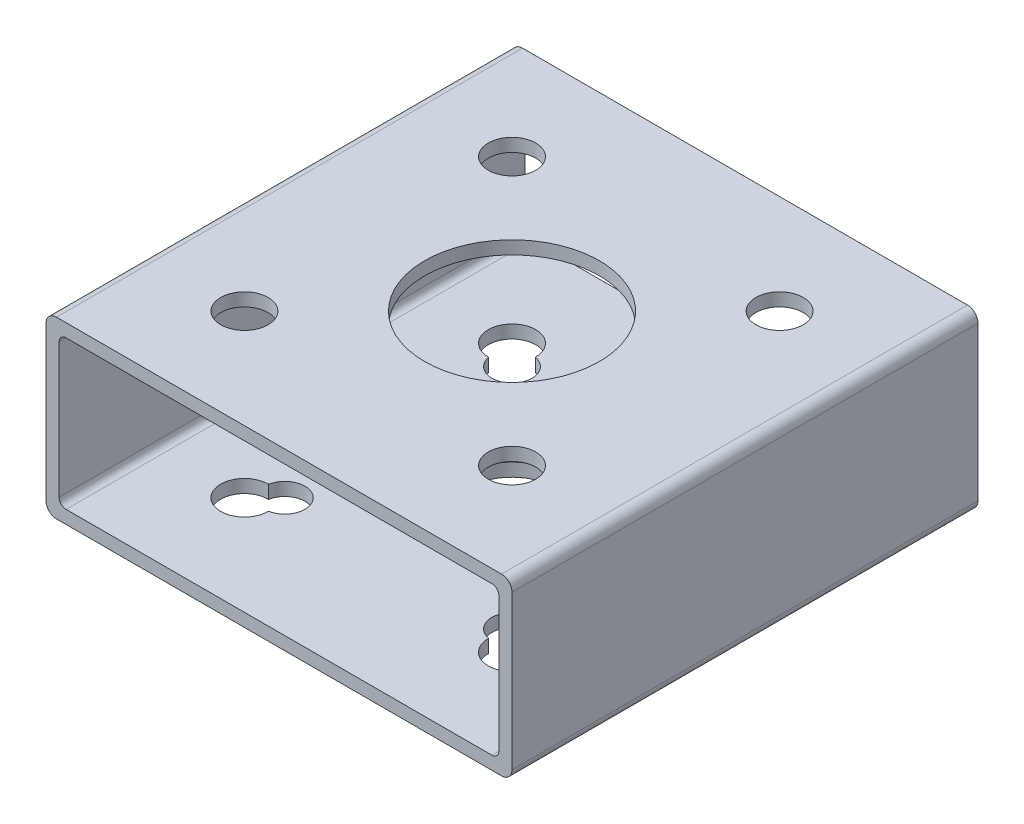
ISO-10303-21;
HEADER;
FILE_DESCRIPTION(('STEP AP214'),'2;1');
FILE_NAME('part.step','',(''),(''),'','','');
FILE_SCHEMA(('AUTOMOTIVE_DESIGN { 1 0 10303 214 1 1 1 1 }'));
ENDSEC;
DATA;
#1=APPLICATION_CONTEXT('core data for automotive mechanical design processes');
#2=APPLICATION_PROTOCOL_DEFINITION('international standard','automotive_design',2000,#1);
#3=PRODUCT_CONTEXT('',#1,'mechanical');
#4=PRODUCT('Part','Part','',(#3));
#5=PRODUCT_RELATED_PRODUCT_CATEGORY('part','',(#4));
#6=PRODUCT_DEFINITION_FORMATION('','',#4);
#7=PRODUCT_DEFINITION_CONTEXT('part definition',#1,'design');
#8=PRODUCT_DEFINITION('design','',#6,#7);
#9=PRODUCT_DEFINITION_SHAPE('','',#8);
#10=(LENGTH_UNIT() NAMED_UNIT(*) SI_UNIT(.MILLI.,.METRE.));
#11=(NAMED_UNIT(*) PLANE_ANGLE_UNIT() SI_UNIT($,.RADIAN.));
#12=(NAMED_UNIT(*) SI_UNIT($,.STERADIAN.) SOLID_ANGLE_UNIT());
#13=UNCERTAINTY_MEASURE_WITH_UNIT(LENGTH_MEASURE(1.E-05),#10,'distance_accuracy_value','');
#14=(GEOMETRIC_REPRESENTATION_CONTEXT(3) GLOBAL_UNCERTAINTY_ASSIGNED_CONTEXT((#13)) GLOBAL_UNIT_ASSIGNED_CONTEXT((#10,
#11,#12)) REPRESENTATION_CONTEXT('',''));
#15=CARTESIAN_POINT('',(0.,0.,0.));
#16=DIRECTION('',(0.,0.,1.));
#17=DIRECTION('',(1.,0.,0.));
#18=AXIS2_PLACEMENT_3D('',#15,#16,#17);
#19=CARTESIAN_POINT('',(203.2,0.,-203.2));
#20=DIRECTION('',(0.,-1.,0.));
#21=DIRECTION('',(1.,0.,0.));
#22=AXIS2_PLACEMENT_3D('',#19,#20,#21);
#23=PLANE('',#22);
#24=CARTESIAN_POINT('',(43.2636905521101,0.,-43.2636905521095));
#25=DIRECTION('',(0.,-1.,0.));
#26=DIRECTION('',(1.,0.,0.));
#27=AXIS2_PLACEMENT_3D('',#24,#25,#26);
#28=CIRCLE('',#27,10.3251);
#29=CARTESIAN_POINT('',(53.5872960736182,0.,-43.4393579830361));
#30=VERTEX_POINT('',#29);
#31=CARTESIAN_POINT('',(43.439357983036,0.,-53.5872960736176));
#32=VERTEX_POINT('',#31);
#33=EDGE_CURVE('E189',#30,#32,#28,.T.);
#34=ORIENTED_EDGE('',*,*,#33,.F.);
#35=CARTESIAN_POINT('',(52.07,0.,-52.07));
#36=DIRECTION('',(0.,-1.,0.));
#37=DIRECTION('',(1.,0.,0.));
#38=AXIS2_PLACEMENT_3D('',#35,#36,#37);
#39=CIRCLE('',#38,8.763);
#40=EDGE_CURVE('E198',#32,#30,#39,.T.);
#41=ORIENTED_EDGE('',*,*,#40,.F.);
#42=EDGE_LOOP('',(#34,#41));
#43=FACE_BOUND('',#42,.T.);
#44=CARTESIAN_POINT('',(159.93630944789,0.,-43.2636905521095));
#45=DIRECTION('',(0.,-1.,0.));
#46=DIRECTION('',(1.,0.,0.));
#47=AXIS2_PLACEMENT_3D('',#44,#45,#46);
#48=CIRCLE('',#47,10.3251);
#49=CARTESIAN_POINT('',(159.760642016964,0.,-53.5872960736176));
#50=VERTEX_POINT('',#49);
#51=CARTESIAN_POINT('',(149.612703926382,0.,-43.4393579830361));
#52=VERTEX_POINT('',#51);
#53=EDGE_CURVE('E385',#50,#52,#48,.T.);
#54=ORIENTED_EDGE('',*,*,#53,.F.);
#55=CARTESIAN_POINT('',(151.13,0.,-52.07));
#56=DIRECTION('',(0.,-1.,0.));
#57=DIRECTION('',(1.,0.,0.));
#58=AXIS2_PLACEMENT_3D('',#55,#56,#57);
#59=CIRCLE('',#58,8.76299999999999);
#60=EDGE_CURVE('E404',#52,#50,#59,.T.);
#61=ORIENTED_EDGE('',*,*,#60,.F.);
#62=EDGE_LOOP('',(#54,#61));
#63=FACE_BOUND('',#62,.T.);
#64=CARTESIAN_POINT('',(159.93630944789,0.,-159.93630944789));
#65=DIRECTION('',(0.,-1.,0.));
#66=DIRECTION('',(1.,0.,0.));
#67=AXIS2_PLACEMENT_3D('',#64,#65,#66);
#68=CIRCLE('',#67,10.3251);
#69=CARTESIAN_POINT('',(149.612703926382,0.,-159.760642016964));
#70=VERTEX_POINT('',#69);
#71=CARTESIAN_POINT('',(159.760642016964,0.,-149.612703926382));
#72=VERTEX_POINT('',#71);
#73=EDGE_CURVE('E389',#70,#72,#68,.T.);
#74=ORIENTED_EDGE('',*,*,#73,.F.);
#75=CARTESIAN_POINT('',(151.13,0.,-151.13));
#76=DIRECTION('',(0.,-1.,0.));
#77=DIRECTION('',(1.,0.,0.));
#78=AXIS2_PLACEMENT_3D('',#75,#76,#77);
#79=CIRCLE('',#78,8.76299999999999);
#80=EDGE_CURVE('E399',#72,#70,#79,.T.);
#81=ORIENTED_EDGE('',*,*,#80,.F.);
#82=EDGE_LOOP('',(#74,#81));
#83=FACE_BOUND('',#82,.T.);
#84=CARTESIAN_POINT('',(43.2636905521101,0.,-159.93630944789));
#85=DIRECTION('',(0.,-1.,0.));
#86=DIRECTION('',(1.,0.,0.));
#87=AXIS2_PLACEMENT_3D('',#84,#85,#86);
#88=CIRCLE('',#87,10.3251);
#89=CARTESIAN_POINT('',(43.439357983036,0.,-149.612703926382));
#90=VERTEX_POINT('',#89);
#91=CARTESIAN_POINT('',(53.5872960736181,0.,-159.760642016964));
#92=VERTEX_POINT('',#91);
#93=EDGE_CURVE('E394',#90,#92,#88,.T.);
#94=ORIENTED_EDGE('',*,*,#93,.F.);
#95=CARTESIAN_POINT('',(52.07,0.,-151.13));
#96=DIRECTION('',(0.,-1.,0.));
#97=DIRECTION('',(1.,0.,0.));
#98=AXIS2_PLACEMENT_3D('',#95,#96,#97);
#99=CIRCLE('',#98,8.763);
#100=EDGE_CURVE('E207',#92,#90,#99,.T.);
#101=ORIENTED_EDGE('',*,*,#100,.F.);
#102=EDGE_LOOP('',(#94,#101));
#103=FACE_BOUND('',#102,.T.);
#104=CARTESIAN_POINT('',(101.6,0.,-101.6));
#105=DIRECTION('',(0.,-1.,0.));
#106=DIRECTION('',(1.,0.,0.));
#107=AXIS2_PLACEMENT_3D('',#104,#105,#106);
#108=CIRCLE('',#107,19.05);
#109=CARTESIAN_POINT('',(120.65,0.,-101.6));
#110=VERTEX_POINT('',#109);
#111=EDGE_CURVE('E204',#110,#110,#108,.T.);
#112=ORIENTED_EDGE('',*,*,#111,.F.);
#113=EDGE_LOOP('',(#112));
#114=FACE_BOUND('',#113,.T.);
#115=DIRECTION('',(1.,0.,0.));
#116=VECTOR('',#115,1.);
#117=CARTESIAN_POINT('',(203.2,0.,-203.2));
#118=LINE('',#117,#116);
#119=CARTESIAN_POINT('',(4.57199999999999,0.,-203.2));
#120=VERTEX_POINT('',#119);
#121=CARTESIAN_POINT('',(198.628,0.,-203.2));
#122=VERTEX_POINT('',#121);
#123=EDGE_CURVE('E271',#120,#122,#118,.T.);
#124=ORIENTED_EDGE('',*,*,#123,.T.);
#125=DIRECTION('',(0.,0.,1.));
#126=VECTOR('',#125,1.);
#127=CARTESIAN_POINT('',(198.628,0.,-203.2));
#128=LINE('',#127,#126);
#129=CARTESIAN_POINT('',(198.628,0.,0.));
#130=VERTEX_POINT('',#129);
#131=EDGE_CURVE('E358',#122,#130,#128,.T.);
#132=ORIENTED_EDGE('',*,*,#131,.T.);
#133=DIRECTION('',(1.,0.,0.));
#134=VECTOR('',#133,1.);
#135=CARTESIAN_POINT('',(203.2,0.,0.));
#136=LINE('',#135,#134);
#137=CARTESIAN_POINT('',(4.57199999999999,0.,0.));
#138=VERTEX_POINT('',#137);
#139=EDGE_CURVE('E260',#138,#130,#136,.T.);
#140=ORIENTED_EDGE('',*,*,#139,.F.);
#141=DIRECTION('',(0.,0.,1.));
#142=VECTOR('',#141,1.);
#143=CARTESIAN_POINT('',(4.57199999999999,0.,-203.2));
#144=LINE('',#143,#142);
#145=EDGE_CURVE('E356',#138,#120,#144,.F.);
#146=ORIENTED_EDGE('',*,*,#145,.T.);
#147=EDGE_LOOP('',(#124,#132,#140,#146));
#148=FACE_BOUND('',#147,.T.);
#149=ADVANCED_FACE('F30',(#43,#63,#83,#103,#114,#148),#23,.T.);
#150=CARTESIAN_POINT('',(0.,0.,-203.2));
#151=DIRECTION('',(-1.,0.,0.));
#152=DIRECTION('',(0.,0.,1.));
#153=AXIS2_PLACEMENT_3D('',#150,#151,#152);
#154=PLANE('',#153);
#155=DIRECTION('',(0.,-1.,0.));
#156=VECTOR('',#155,1.);
#157=CARTESIAN_POINT('',(0.,0.,-203.2));
#158=LINE('',#157,#156);
#159=CARTESIAN_POINT('',(0.,71.628,-203.2));
#160=VERTEX_POINT('',#159);
#161=CARTESIAN_POINT('',(0.,4.572,-203.2));
#162=VERTEX_POINT('',#161);
#163=EDGE_CURVE('E281',#160,#162,#158,.T.);
#164=ORIENTED_EDGE('',*,*,#163,.T.);
#165=DIRECTION('',(0.,0.,1.));
#166=VECTOR('',#165,1.);
#167=CARTESIAN_POINT('',(0.,4.572,-203.2));
#168=LINE('',#167,#166);
#169=CARTESIAN_POINT('',(0.,4.572,0.));
#170=VERTEX_POINT('',#169);
#171=EDGE_CURVE('E363',#162,#170,#168,.T.);
#172=ORIENTED_EDGE('',*,*,#171,.T.);
#173=DIRECTION('',(0.,-1.,0.));
#174=VECTOR('',#173,1.);
#175=CARTESIAN_POINT('',(0.,0.,0.));
#176=LINE('',#175,#174);
#177=CARTESIAN_POINT('',(0.,71.628,0.));
#178=VERTEX_POINT('',#177);
#179=EDGE_CURVE('E275',#178,#170,#176,.T.);
#180=ORIENTED_EDGE('',*,*,#179,.F.);
#181=DIRECTION('',(0.,0.,1.));
#182=VECTOR('',#181,1.);
#183=CARTESIAN_POINT('',(0.,71.628,-203.2));
#184=LINE('',#183,#182);
#185=EDGE_CURVE('E361',#178,#160,#184,.F.);
#186=ORIENTED_EDGE('',*,*,#185,.T.);
#187=EDGE_LOOP('',(#164,#172,#180,#186));
#188=FACE_BOUND('',#187,.T.);
#189=ADVANCED_FACE('F441',(#188),#154,.T.);
#190=CARTESIAN_POINT('',(0.,76.2,-203.2));
#191=DIRECTION('',(0.,1.,0.));
#192=DIRECTION('',(0.,0.,1.));
#193=AXIS2_PLACEMENT_3D('',#190,#191,#192);
#194=PLANE('',#193);
#195=CARTESIAN_POINT('',(43.2636905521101,76.2,-43.2636905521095));
#196=DIRECTION('',(0.,1.,0.));
#197=DIRECTION('',(0.,0.,-1.));
#198=AXIS2_PLACEMENT_3D('',#195,#196,#197);
#199=CIRCLE('',#198,10.3251);
#200=CARTESIAN_POINT('',(43.2636905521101,76.2,-53.5887905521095));
#201=VERTEX_POINT('',#200);
#202=EDGE_CURVE('E214',#201,#201,#199,.T.);
#203=ORIENTED_EDGE('',*,*,#202,.F.);
#204=EDGE_LOOP('',(#203));
#205=FACE_BOUND('',#204,.T.);
#206=CARTESIAN_POINT('',(43.2636905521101,76.2,-159.93630944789));
#207=DIRECTION('',(0.,1.,0.));
#208=DIRECTION('',(0.,0.,-1.));
#209=AXIS2_PLACEMENT_3D('',#206,#207,#208);
#210=CIRCLE('',#209,10.3251);
#211=CARTESIAN_POINT('',(43.2636905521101,76.2,-170.26140944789));
#212=VERTEX_POINT('',#211);
#213=EDGE_CURVE('E220',#212,#212,#210,.T.);
#214=ORIENTED_EDGE('',*,*,#213,.F.);
#215=EDGE_LOOP('',(#214));
#216=FACE_BOUND('',#215,.T.);
#217=CARTESIAN_POINT('',(159.93630944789,76.2,-43.2636905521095));
#218=DIRECTION('',(0.,1.,0.));
#219=DIRECTION('',(0.,0.,1.));
#220=AXIS2_PLACEMENT_3D('',#217,#218,#219);
#221=CIRCLE('',#220,10.3251);
#222=CARTESIAN_POINT('',(159.93630944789,76.2,-32.9385905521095));
#223=VERTEX_POINT('',#222);
#224=EDGE_CURVE('E226',#223,#223,#221,.T.);
#225=ORIENTED_EDGE('',*,*,#224,.F.);
#226=EDGE_LOOP('',(#225));
#227=FACE_BOUND('',#226,.T.);
#228=CARTESIAN_POINT('',(159.93630944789,76.2,-159.93630944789));
#229=DIRECTION('',(0.,1.,0.));
#230=DIRECTION('',(0.,0.,1.));
#231=AXIS2_PLACEMENT_3D('',#228,#229,#230);
#232=CIRCLE('',#231,10.3251);
#233=CARTESIAN_POINT('',(159.93630944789,76.2,-149.61120944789));
#234=VERTEX_POINT('',#233);
#235=EDGE_CURVE('E232',#234,#234,#232,.T.);
#236=ORIENTED_EDGE('',*,*,#235,.F.);
#237=EDGE_LOOP('',(#236));
#238=FACE_BOUND('',#237,.T.);
#239=CARTESIAN_POINT('',(101.6,76.2,-101.6));
#240=DIRECTION('',(0.,1.,0.));
#241=DIRECTION('',(0.,0.,1.));
#242=AXIS2_PLACEMENT_3D('',#239,#240,#241);
#243=CIRCLE('',#242,38.1);
#244=CARTESIAN_POINT('',(101.6,76.2,-63.5));
#245=VERTEX_POINT('',#244);
#246=EDGE_CURVE('E238',#245,#245,#243,.T.);
#247=ORIENTED_EDGE('',*,*,#246,.F.);
#248=EDGE_LOOP('',(#247));
#249=FACE_BOUND('',#248,.T.);
#250=DIRECTION('',(-1.,0.,0.));
#251=VECTOR('',#250,1.);
#252=CARTESIAN_POINT('',(0.,76.2,0.));
#253=LINE('',#252,#251);
#254=CARTESIAN_POINT('',(198.628,76.2,0.));
#255=VERTEX_POINT('',#254);
#256=CARTESIAN_POINT('',(4.572,76.2,0.));
#257=VERTEX_POINT('',#256);
#258=EDGE_CURVE('E290',#255,#257,#253,.T.);
#259=ORIENTED_EDGE('',*,*,#258,.F.);
#260=DIRECTION('',(0.,0.,1.));
#261=VECTOR('',#260,1.);
#262=CARTESIAN_POINT('',(198.628,76.2,-203.2));
#263=LINE('',#262,#261);
#264=CARTESIAN_POINT('',(198.628,76.2,-203.2));
#265=VERTEX_POINT('',#264);
#266=EDGE_CURVE('E346',#255,#265,#263,.F.);
#267=ORIENTED_EDGE('',*,*,#266,.T.);
#268=DIRECTION('',(-1.,0.,0.));
#269=VECTOR('',#268,1.);
#270=CARTESIAN_POINT('',(0.,76.2,-203.2));
#271=LINE('',#270,#269);
#272=CARTESIAN_POINT('',(4.572,76.2,-203.2));
#273=VERTEX_POINT('',#272);
#274=EDGE_CURVE('E278',#265,#273,#271,.T.);
#275=ORIENTED_EDGE('',*,*,#274,.T.);
#276=DIRECTION('',(0.,0.,1.));
#277=VECTOR('',#276,1.);
#278=CARTESIAN_POINT('',(4.572,76.2,-203.2));
#279=LINE('',#278,#277);
#280=EDGE_CURVE('E343',#273,#257,#279,.T.);
#281=ORIENTED_EDGE('',*,*,#280,.T.);
#282=EDGE_LOOP('',(#259,#267,#275,#281));
#283=FACE_BOUND('',#282,.T.);
#284=ADVANCED_FACE('F446',(#205,#216,#227,#238,#249,#283),#194,.T.);
#285=CARTESIAN_POINT('',(203.2,76.2,-203.2));
#286=DIRECTION('',(1.,0.,0.));
#287=DIRECTION('',(0.,0.,-1.));
#288=AXIS2_PLACEMENT_3D('',#285,#286,#287);
#289=PLANE('',#288);
#290=DIRECTION('',(0.,1.,0.));
#291=VECTOR('',#290,1.);
#292=CARTESIAN_POINT('',(203.2,76.2,-203.2));
#293=LINE('',#292,#291);
#294=CARTESIAN_POINT('',(203.2,4.57200000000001,-203.2));
#295=VERTEX_POINT('',#294);
#296=CARTESIAN_POINT('',(203.2,71.628,-203.2));
#297=VERTEX_POINT('',#296);
#298=EDGE_CURVE('E274',#295,#297,#293,.T.);
#299=ORIENTED_EDGE('',*,*,#298,.T.);
#300=DIRECTION('',(0.,0.,1.));
#301=VECTOR('',#300,1.);
#302=CARTESIAN_POINT('',(203.2,71.628,-203.2));
#303=LINE('',#302,#301);
#304=CARTESIAN_POINT('',(203.2,71.628,0.));
#305=VERTEX_POINT('',#304);
#306=EDGE_CURVE('E332',#297,#305,#303,.T.);
#307=ORIENTED_EDGE('',*,*,#306,.T.);
#308=DIRECTION('',(0.,1.,0.));
#309=VECTOR('',#308,1.);
#310=CARTESIAN_POINT('',(203.2,76.2,0.));
#311=LINE('',#310,#309);
#312=CARTESIAN_POINT('',(203.2,4.57200000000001,0.));
#313=VERTEX_POINT('',#312);
#314=EDGE_CURVE('E287',#313,#305,#311,.T.);
#315=ORIENTED_EDGE('',*,*,#314,.F.);
#316=DIRECTION('',(0.,0.,1.));
#317=VECTOR('',#316,1.);
#318=CARTESIAN_POINT('',(203.2,4.57200000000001,-203.2));
#319=LINE('',#318,#317);
#320=EDGE_CURVE('E330',#313,#295,#319,.F.);
#321=ORIENTED_EDGE('',*,*,#320,.T.);
#322=EDGE_LOOP('',(#299,#307,#315,#321));
#323=FACE_BOUND('',#322,.T.);
#324=ADVANCED_FACE('F451',(#323),#289,.T.);
#325=CARTESIAN_POINT('',(203.2,0.,-203.2));
#326=DIRECTION('',(0.,0.,1.));
#327=DIRECTION('',(1.,0.,0.));
#328=AXIS2_PLACEMENT_3D('',#325,#326,#327);
#329=PLANE('',#328);
#330=DIRECTION('',(-1.,0.,0.));
#331=VECTOR('',#330,1.);
#332=CARTESIAN_POINT('',(0.,70.485,-203.2));
#333=LINE('',#332,#331);
#334=CARTESIAN_POINT('',(194.437,70.485,-203.2));
#335=VERTEX_POINT('',#334);
#336=CARTESIAN_POINT('',(8.763,70.485,-203.2));
#337=VERTEX_POINT('',#336);
#338=EDGE_CURVE('E254',#335,#337,#333,.T.);
#339=ORIENTED_EDGE('',*,*,#338,.T.);
#340=CARTESIAN_POINT('',(8.763,67.437,-203.2));
#341=DIRECTION('',(0.,0.,1.));
#342=DIRECTION('',(1.,0.,0.));
#343=AXIS2_PLACEMENT_3D('',#340,#341,#342);
#344=CIRCLE('',#343,3.048);
#345=CARTESIAN_POINT('',(5.715,67.437,-203.2));
#346=VERTEX_POINT('',#345);
#347=EDGE_CURVE('E316',#337,#346,#344,.T.);
#348=ORIENTED_EDGE('',*,*,#347,.T.);
#349=DIRECTION('',(0.,-1.,0.));
#350=VECTOR('',#349,1.);
#351=CARTESIAN_POINT('',(5.715,0.,-203.2));
#352=LINE('',#351,#350);
#353=CARTESIAN_POINT('',(5.715,8.763,-203.2));
#354=VERTEX_POINT('',#353);
#355=EDGE_CURVE('E257',#346,#354,#352,.T.);
#356=ORIENTED_EDGE('',*,*,#355,.T.);
#357=CARTESIAN_POINT('',(8.763,8.763,-203.2));
#358=DIRECTION('',(0.,0.,1.));
#359=DIRECTION('',(1.,0.,0.));
#360=AXIS2_PLACEMENT_3D('',#357,#358,#359);
#361=CIRCLE('',#360,3.048);
#362=CARTESIAN_POINT('',(8.763,5.715,-203.2));
#363=VERTEX_POINT('',#362);
#364=EDGE_CURVE('E328',#354,#363,#361,.T.);
#365=ORIENTED_EDGE('',*,*,#364,.T.);
#366=DIRECTION('',(1.,0.,0.));
#367=VECTOR('',#366,1.);
#368=CARTESIAN_POINT('',(0.,5.715,-203.2));
#369=LINE('',#368,#367);
#370=CARTESIAN_POINT('',(194.437,5.71500000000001,-203.2));
#371=VERTEX_POINT('',#370);
#372=EDGE_CURVE('E247',#363,#371,#369,.T.);
#373=ORIENTED_EDGE('',*,*,#372,.T.);
#374=CARTESIAN_POINT('',(194.437,8.76300000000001,-203.2));
#375=DIRECTION('',(0.,0.,1.));
#376=DIRECTION('',(1.,0.,0.));
#377=AXIS2_PLACEMENT_3D('',#374,#375,#376);
#378=CIRCLE('',#377,3.048);
#379=CARTESIAN_POINT('',(197.485,8.76300000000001,-203.2));
#380=VERTEX_POINT('',#379);
#381=EDGE_CURVE('E324',#371,#380,#378,.T.);
#382=ORIENTED_EDGE('',*,*,#381,.T.);
#383=DIRECTION('',(0.,1.,0.));
#384=VECTOR('',#383,1.);
#385=CARTESIAN_POINT('',(197.485,0.,-203.2));
#386=LINE('',#385,#384);
#387=CARTESIAN_POINT('',(197.485,67.437,-203.2));
#388=VERTEX_POINT('',#387);
#389=EDGE_CURVE('E250',#380,#388,#386,.T.);
#390=ORIENTED_EDGE('',*,*,#389,.T.);
#391=CARTESIAN_POINT('',(194.437,67.437,-203.2));
#392=DIRECTION('',(0.,0.,1.));
#393=DIRECTION('',(1.,0.,0.));
#394=AXIS2_PLACEMENT_3D('',#391,#392,#393);
#395=CIRCLE('',#394,3.048);
#396=EDGE_CURVE('E320',#388,#335,#395,.T.);
#397=ORIENTED_EDGE('',*,*,#396,.T.);
#398=EDGE_LOOP('',(#339,#348,#356,#365,#373,#382,#390,#397));
#399=FACE_BOUND('',#398,.T.);
#400=ORIENTED_EDGE('',*,*,#274,.F.);
#401=CARTESIAN_POINT('',(198.628,71.628,-203.2));
#402=DIRECTION('',(0.,0.,1.));
#403=DIRECTION('',(1.,0.,0.));
#404=AXIS2_PLACEMENT_3D('',#401,#402,#403);
#405=CIRCLE('',#404,4.572);
#406=EDGE_CURVE('E354',#265,#297,#405,.F.);
#407=ORIENTED_EDGE('',*,*,#406,.T.);
#408=ORIENTED_EDGE('',*,*,#298,.F.);
#409=CARTESIAN_POINT('',(198.628,4.57200000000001,-203.2));
#410=DIRECTION('',(0.,0.,1.));
#411=DIRECTION('',(1.,0.,0.));
#412=AXIS2_PLACEMENT_3D('',#409,#410,#411);
#413=CIRCLE('',#412,4.572);
#414=EDGE_CURVE('E352',#295,#122,#413,.F.);
#415=ORIENTED_EDGE('',*,*,#414,.T.);
#416=ORIENTED_EDGE('',*,*,#123,.F.);
#417=CARTESIAN_POINT('',(4.572,4.572,-203.2));
#418=DIRECTION('',(0.,0.,1.));
#419=DIRECTION('',(1.,0.,0.));
#420=AXIS2_PLACEMENT_3D('',#417,#418,#419);
#421=CIRCLE('',#420,4.572);
#422=EDGE_CURVE('E350',#120,#162,#421,.F.);
#423=ORIENTED_EDGE('',*,*,#422,.T.);
#424=ORIENTED_EDGE('',*,*,#163,.F.);
#425=CARTESIAN_POINT('',(4.572,71.628,-203.2));
#426=DIRECTION('',(0.,0.,1.));
#427=DIRECTION('',(1.,0.,0.));
#428=AXIS2_PLACEMENT_3D('',#425,#426,#427);
#429=CIRCLE('',#428,4.572);
#430=EDGE_CURVE('E348',#160,#273,#429,.F.);
#431=ORIENTED_EDGE('',*,*,#430,.T.);
#432=EDGE_LOOP('',(#400,#407,#408,#415,#416,#423,#424,#431));
#433=FACE_BOUND('',#432,.T.);
#434=ADVANCED_FACE('F434',(#399,#433),#329,.F.);
#435=CARTESIAN_POINT('',(203.2,0.,0.));
#436=DIRECTION('',(0.,0.,1.));
#437=DIRECTION('',(1.,0.,0.));
#438=AXIS2_PLACEMENT_3D('',#435,#436,#437);
#439=PLANE('',#438);
#440=DIRECTION('',(1.,0.,0.));
#441=VECTOR('',#440,1.);
#442=CARTESIAN_POINT('',(0.,5.715,0.));
#443=LINE('',#442,#441);
#444=CARTESIAN_POINT('',(8.763,5.715,0.));
#445=VERTEX_POINT('',#444);
#446=CARTESIAN_POINT('',(194.437,5.71500000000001,0.));
#447=VERTEX_POINT('',#446);
#448=EDGE_CURVE('E244',#445,#447,#443,.T.);
#449=ORIENTED_EDGE('',*,*,#448,.F.);
#450=CARTESIAN_POINT('',(8.763,8.763,0.));
#451=DIRECTION('',(0.,0.,1.));
#452=DIRECTION('',(1.,0.,0.));
#453=AXIS2_PLACEMENT_3D('',#450,#451,#452);
#454=CIRCLE('',#453,3.048);
#455=CARTESIAN_POINT('',(5.715,8.763,0.));
#456=VERTEX_POINT('',#455);
#457=EDGE_CURVE('E326',#445,#456,#454,.F.);
#458=ORIENTED_EDGE('',*,*,#457,.T.);
#459=DIRECTION('',(0.,-1.,0.));
#460=VECTOR('',#459,1.);
#461=CARTESIAN_POINT('',(5.715,0.,0.));
#462=LINE('',#461,#460);
#463=CARTESIAN_POINT('',(5.715,67.437,0.));
#464=VERTEX_POINT('',#463);
#465=EDGE_CURVE('E251',#464,#456,#462,.T.);
#466=ORIENTED_EDGE('',*,*,#465,.F.);
#467=CARTESIAN_POINT('',(8.763,67.437,0.));
#468=DIRECTION('',(0.,0.,1.));
#469=DIRECTION('',(1.,0.,0.));
#470=AXIS2_PLACEMENT_3D('',#467,#468,#469);
#471=CIRCLE('',#470,3.048);
#472=CARTESIAN_POINT('',(8.763,70.485,0.));
#473=VERTEX_POINT('',#472);
#474=EDGE_CURVE('E314',#464,#473,#471,.F.);
#475=ORIENTED_EDGE('',*,*,#474,.T.);
#476=DIRECTION('',(-1.,0.,0.));
#477=VECTOR('',#476,1.);
#478=CARTESIAN_POINT('',(0.,70.485,0.));
#479=LINE('',#478,#477);
#480=CARTESIAN_POINT('',(194.437,70.485,0.));
#481=VERTEX_POINT('',#480);
#482=EDGE_CURVE('E266',#481,#473,#479,.T.);
#483=ORIENTED_EDGE('',*,*,#482,.F.);
#484=CARTESIAN_POINT('',(194.437,67.437,0.));
#485=DIRECTION('',(0.,0.,1.));
#486=DIRECTION('',(1.,0.,0.));
#487=AXIS2_PLACEMENT_3D('',#484,#485,#486);
#488=CIRCLE('',#487,3.048);
#489=CARTESIAN_POINT('',(197.485,67.437,0.));
#490=VERTEX_POINT('',#489);
#491=EDGE_CURVE('E318',#481,#490,#488,.F.);
#492=ORIENTED_EDGE('',*,*,#491,.T.);
#493=DIRECTION('',(0.,1.,0.));
#494=VECTOR('',#493,1.);
#495=CARTESIAN_POINT('',(197.485,0.,0.));
#496=LINE('',#495,#494);
#497=CARTESIAN_POINT('',(197.485,8.76300000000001,0.));
#498=VERTEX_POINT('',#497);
#499=EDGE_CURVE('E263',#498,#490,#496,.T.);
#500=ORIENTED_EDGE('',*,*,#499,.F.);
#501=CARTESIAN_POINT('',(194.437,8.76300000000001,0.));
#502=DIRECTION('',(0.,0.,1.));
#503=DIRECTION('',(1.,0.,0.));
#504=AXIS2_PLACEMENT_3D('',#501,#502,#503);
#505=CIRCLE('',#504,3.048);
#506=EDGE_CURVE('E322',#498,#447,#505,.F.);
#507=ORIENTED_EDGE('',*,*,#506,.T.);
#508=EDGE_LOOP('',(#449,#458,#466,#475,#483,#492,#500,#507));
#509=FACE_BOUND('',#508,.T.);
#510=ORIENTED_EDGE('',*,*,#314,.T.);
#511=CARTESIAN_POINT('',(198.628,71.628,0.));
#512=DIRECTION('',(0.,0.,1.));
#513=DIRECTION('',(1.,0.,0.));
#514=AXIS2_PLACEMENT_3D('',#511,#512,#513);
#515=CIRCLE('',#514,4.572);
#516=EDGE_CURVE('E341',#305,#255,#515,.T.);
#517=ORIENTED_EDGE('',*,*,#516,.T.);
#518=ORIENTED_EDGE('',*,*,#258,.T.);
#519=CARTESIAN_POINT('',(4.572,71.628,0.));
#520=DIRECTION('',(0.,0.,1.));
#521=DIRECTION('',(1.,0.,0.));
#522=AXIS2_PLACEMENT_3D('',#519,#520,#521);
#523=CIRCLE('',#522,4.572);
#524=EDGE_CURVE('E335',#257,#178,#523,.T.);
#525=ORIENTED_EDGE('',*,*,#524,.T.);
#526=ORIENTED_EDGE('',*,*,#179,.T.);
#527=CARTESIAN_POINT('',(4.572,4.572,0.));
#528=DIRECTION('',(0.,0.,1.));
#529=DIRECTION('',(1.,0.,0.));
#530=AXIS2_PLACEMENT_3D('',#527,#528,#529);
#531=CIRCLE('',#530,4.572);
#532=EDGE_CURVE('E337',#170,#138,#531,.T.);
#533=ORIENTED_EDGE('',*,*,#532,.T.);
#534=ORIENTED_EDGE('',*,*,#139,.T.);
#535=CARTESIAN_POINT('',(198.628,4.57200000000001,0.));
#536=DIRECTION('',(0.,0.,1.));
#537=DIRECTION('',(1.,0.,0.));
#538=AXIS2_PLACEMENT_3D('',#535,#536,#537);
#539=CIRCLE('',#538,4.572);
#540=EDGE_CURVE('E339',#130,#313,#539,.T.);
#541=ORIENTED_EDGE('',*,*,#540,.T.);
#542=EDGE_LOOP('',(#510,#517,#518,#525,#526,#533,#534,#541));
#543=FACE_BOUND('',#542,.T.);
#544=ADVANCED_FACE('F424',(#509,#543),#439,.T.);
#545=CARTESIAN_POINT('',(0.,5.715,-203.2));
#546=DIRECTION('',(0.,-1.,0.));
#547=DIRECTION('',(1.,0.,0.));
#548=AXIS2_PLACEMENT_3D('',#545,#546,#547);
#549=PLANE('',#548);
#550=CARTESIAN_POINT('',(151.13,5.715,-151.13));
#551=DIRECTION('',(0.,-1.,0.));
#552=DIRECTION('',(1.,0.,0.));
#553=AXIS2_PLACEMENT_3D('',#550,#551,#552);
#554=CIRCLE('',#553,8.76299999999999);
#555=CARTESIAN_POINT('',(159.760642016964,5.71500000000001,-149.612703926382));
#556=VERTEX_POINT('',#555);
#557=CARTESIAN_POINT('',(149.612703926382,5.715,-159.760642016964));
#558=VERTEX_POINT('',#557);
#559=EDGE_CURVE('E401',#556,#558,#554,.T.);
#560=ORIENTED_EDGE('',*,*,#559,.T.);
#561=CARTESIAN_POINT('',(159.93630944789,5.71500000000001,-159.93630944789));
#562=DIRECTION('',(0.,-1.,0.));
#563=DIRECTION('',(1.,0.,0.));
#564=AXIS2_PLACEMENT_3D('',#561,#562,#563);
#565=CIRCLE('',#564,10.3251);
#566=EDGE_CURVE('E391',#558,#556,#565,.T.);
#567=ORIENTED_EDGE('',*,*,#566,.T.);
#568=EDGE_LOOP('',(#560,#567));
#569=FACE_BOUND('',#568,.T.);
#570=CARTESIAN_POINT('',(151.13,5.715,-52.07));
#571=DIRECTION('',(0.,-1.,0.));
#572=DIRECTION('',(1.,0.,0.));
#573=AXIS2_PLACEMENT_3D('',#570,#571,#572);
#574=CIRCLE('',#573,8.76299999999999);
#575=CARTESIAN_POINT('',(149.612703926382,5.71500000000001,-43.4393579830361));
#576=VERTEX_POINT('',#575);
#577=CARTESIAN_POINT('',(159.760642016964,5.715,-53.5872960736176));
#578=VERTEX_POINT('',#577);
#579=EDGE_CURVE('E407',#576,#578,#574,.T.);
#580=ORIENTED_EDGE('',*,*,#579,.T.);
#581=CARTESIAN_POINT('',(159.93630944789,5.71500000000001,-43.2636905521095));
#582=DIRECTION('',(0.,-1.,0.));
#583=DIRECTION('',(1.,0.,0.));
#584=AXIS2_PLACEMENT_3D('',#581,#582,#583);
#585=CIRCLE('',#584,10.3251);
#586=EDGE_CURVE('E53',#578,#576,#585,.T.);
#587=ORIENTED_EDGE('',*,*,#586,.T.);
#588=EDGE_LOOP('',(#580,#587));
#589=FACE_BOUND('',#588,.T.);
#590=CARTESIAN_POINT('',(52.07,5.715,-151.13));
#591=DIRECTION('',(0.,-1.,0.));
#592=DIRECTION('',(1.,0.,0.));
#593=AXIS2_PLACEMENT_3D('',#590,#591,#592);
#594=CIRCLE('',#593,8.763);
#595=CARTESIAN_POINT('',(53.5872960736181,5.715,-159.760642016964));
#596=VERTEX_POINT('',#595);
#597=CARTESIAN_POINT('',(43.439357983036,5.715,-149.612703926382));
#598=VERTEX_POINT('',#597);
#599=EDGE_CURVE('E202',#596,#598,#594,.T.);
#600=ORIENTED_EDGE('',*,*,#599,.T.);
#601=CARTESIAN_POINT('',(43.2636905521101,5.715,-159.93630944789));
#602=DIRECTION('',(0.,-1.,0.));
#603=DIRECTION('',(1.,0.,0.));
#604=AXIS2_PLACEMENT_3D('',#601,#602,#603);
#605=CIRCLE('',#604,10.3251);
#606=EDGE_CURVE('E396',#598,#596,#605,.T.);
#607=ORIENTED_EDGE('',*,*,#606,.T.);
#608=EDGE_LOOP('',(#600,#607));
#609=FACE_BOUND('',#608,.T.);
#610=CARTESIAN_POINT('',(52.07,5.715,-52.07));
#611=DIRECTION('',(0.,-1.,0.));
#612=DIRECTION('',(1.,0.,0.));
#613=AXIS2_PLACEMENT_3D('',#610,#611,#612);
#614=CIRCLE('',#613,8.763);
#615=CARTESIAN_POINT('',(43.439357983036,5.715,-53.5872960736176));
#616=VERTEX_POINT('',#615);
#617=CARTESIAN_POINT('',(53.5872960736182,5.715,-43.4393579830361));
#618=VERTEX_POINT('',#617);
#619=EDGE_CURVE('E200',#616,#618,#614,.T.);
#620=ORIENTED_EDGE('',*,*,#619,.T.);
#621=CARTESIAN_POINT('',(43.2636905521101,5.715,-43.2636905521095));
#622=DIRECTION('',(0.,-1.,0.));
#623=DIRECTION('',(1.,0.,0.));
#624=AXIS2_PLACEMENT_3D('',#621,#622,#623);
#625=CIRCLE('',#624,10.3251);
#626=EDGE_CURVE('E45',#618,#616,#625,.T.);
#627=ORIENTED_EDGE('',*,*,#626,.T.);
#628=EDGE_LOOP('',(#620,#627));
#629=FACE_BOUND('',#628,.T.);
#630=CARTESIAN_POINT('',(101.6,5.715,-101.6));
#631=DIRECTION('',(0.,-1.,0.));
#632=DIRECTION('',(1.,0.,0.));
#633=AXIS2_PLACEMENT_3D('',#630,#631,#632);
#634=CIRCLE('',#633,19.05);
#635=CARTESIAN_POINT('',(120.65,5.715,-101.6));
#636=VERTEX_POINT('',#635);
#637=EDGE_CURVE('E211',#636,#636,#634,.T.);
#638=ORIENTED_EDGE('',*,*,#637,.T.);
#639=EDGE_LOOP('',(#638));
#640=FACE_BOUND('',#639,.T.);
#641=ORIENTED_EDGE('',*,*,#448,.T.);
#642=DIRECTION('',(0.,0.,1.));
#643=VECTOR('',#642,1.);
#644=CARTESIAN_POINT('',(194.437,5.71500000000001,-203.2));
#645=LINE('',#644,#643);
#646=EDGE_CURVE('E312',#447,#371,#645,.F.);
#647=ORIENTED_EDGE('',*,*,#646,.T.);
#648=ORIENTED_EDGE('',*,*,#372,.F.);
#649=DIRECTION('',(0.,0.,1.));
#650=VECTOR('',#649,1.);
#651=CARTESIAN_POINT('',(8.763,5.715,0.));
#652=LINE('',#651,#650);
#653=EDGE_CURVE('E309',#363,#445,#652,.T.);
#654=ORIENTED_EDGE('',*,*,#653,.T.);
#655=EDGE_LOOP('',(#641,#647,#648,#654));
#656=FACE_BOUND('',#655,.T.);
#657=ADVANCED_FACE('F383',(#569,#589,#609,#629,#640,#656),#549,.F.);
#658=CARTESIAN_POINT('',(5.715,0.,-203.2));
#659=DIRECTION('',(-1.,0.,0.));
#660=DIRECTION('',(0.,0.,1.));
#661=AXIS2_PLACEMENT_3D('',#658,#659,#660);
#662=PLANE('',#661);
#663=ORIENTED_EDGE('',*,*,#355,.F.);
#664=DIRECTION('',(0.,0.,1.));
#665=VECTOR('',#664,1.);
#666=CARTESIAN_POINT('',(5.715,67.437,0.));
#667=LINE('',#666,#665);
#668=EDGE_CURVE('E296',#346,#464,#667,.T.);
#669=ORIENTED_EDGE('',*,*,#668,.T.);
#670=ORIENTED_EDGE('',*,*,#465,.T.);
#671=DIRECTION('',(0.,0.,1.));
#672=VECTOR('',#671,1.);
#673=CARTESIAN_POINT('',(5.715,8.763,-203.2));
#674=LINE('',#673,#672);
#675=EDGE_CURVE('E284',#456,#354,#674,.F.);
#676=ORIENTED_EDGE('',*,*,#675,.T.);
#677=EDGE_LOOP('',(#663,#669,#670,#676));
#678=FACE_BOUND('',#677,.T.);
#679=ADVANCED_FACE('F423',(#678),#662,.F.);
#680=CARTESIAN_POINT('',(0.,70.485,-203.2));
#681=DIRECTION('',(0.,1.,0.));
#682=DIRECTION('',(0.,0.,1.));
#683=AXIS2_PLACEMENT_3D('',#680,#681,#682);
#684=PLANE('',#683);
#685=CARTESIAN_POINT('',(43.2636905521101,70.485,-43.2636905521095));
#686=DIRECTION('',(0.,1.,0.));
#687=DIRECTION('',(0.,0.,-1.));
#688=AXIS2_PLACEMENT_3D('',#685,#686,#687);
#689=CIRCLE('',#688,10.3251);
#690=CARTESIAN_POINT('',(43.2636905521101,70.485,-53.5887905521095));
#691=VERTEX_POINT('',#690);
#692=EDGE_CURVE('E217',#691,#691,#689,.T.);
#693=ORIENTED_EDGE('',*,*,#692,.T.);
#694=EDGE_LOOP('',(#693));
#695=FACE_BOUND('',#694,.T.);
#696=CARTESIAN_POINT('',(43.2636905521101,70.485,-159.93630944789));
#697=DIRECTION('',(0.,1.,0.));
#698=DIRECTION('',(0.,0.,-1.));
#699=AXIS2_PLACEMENT_3D('',#696,#697,#698);
#700=CIRCLE('',#699,10.3251);
#701=CARTESIAN_POINT('',(43.2636905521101,70.485,-170.26140944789));
#702=VERTEX_POINT('',#701);
#703=EDGE_CURVE('E223',#702,#702,#700,.T.);
#704=ORIENTED_EDGE('',*,*,#703,.T.);
#705=EDGE_LOOP('',(#704));
#706=FACE_BOUND('',#705,.T.);
#707=CARTESIAN_POINT('',(159.93630944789,70.485,-43.2636905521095));
#708=DIRECTION('',(0.,1.,0.));
#709=DIRECTION('',(0.,0.,1.));
#710=AXIS2_PLACEMENT_3D('',#707,#708,#709);
#711=CIRCLE('',#710,10.3251);
#712=CARTESIAN_POINT('',(159.93630944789,70.485,-32.9385905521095));
#713=VERTEX_POINT('',#712);
#714=EDGE_CURVE('E229',#713,#713,#711,.T.);
#715=ORIENTED_EDGE('',*,*,#714,.T.);
#716=EDGE_LOOP('',(#715));
#717=FACE_BOUND('',#716,.T.);
#718=CARTESIAN_POINT('',(159.93630944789,70.485,-159.93630944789));
#719=DIRECTION('',(0.,1.,0.));
#720=DIRECTION('',(0.,0.,1.));
#721=AXIS2_PLACEMENT_3D('',#718,#719,#720);
#722=CIRCLE('',#721,10.3251);
#723=CARTESIAN_POINT('',(159.93630944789,70.485,-149.61120944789));
#724=VERTEX_POINT('',#723);
#725=EDGE_CURVE('E235',#724,#724,#722,.T.);
#726=ORIENTED_EDGE('',*,*,#725,.T.);
#727=EDGE_LOOP('',(#726));
#728=FACE_BOUND('',#727,.T.);
#729=CARTESIAN_POINT('',(101.6,70.485,-101.6));
#730=DIRECTION('',(0.,1.,0.));
#731=DIRECTION('',(0.,0.,1.));
#732=AXIS2_PLACEMENT_3D('',#729,#730,#731);
#733=CIRCLE('',#732,38.1);
#734=CARTESIAN_POINT('',(101.6,70.485,-63.5));
#735=VERTEX_POINT('',#734);
#736=EDGE_CURVE('E241',#735,#735,#733,.T.);
#737=ORIENTED_EDGE('',*,*,#736,.T.);
#738=EDGE_LOOP('',(#737));
#739=FACE_BOUND('',#738,.T.);
#740=ORIENTED_EDGE('',*,*,#482,.T.);
#741=DIRECTION('',(0.,0.,1.));
#742=VECTOR('',#741,1.);
#743=CARTESIAN_POINT('',(8.763,70.485,-203.2));
#744=LINE('',#743,#742);
#745=EDGE_CURVE('E302',#473,#337,#744,.F.);
#746=ORIENTED_EDGE('',*,*,#745,.T.);
#747=ORIENTED_EDGE('',*,*,#338,.F.);
#748=DIRECTION('',(0.,0.,1.));
#749=VECTOR('',#748,1.);
#750=CARTESIAN_POINT('',(194.437,70.485,0.));
#751=LINE('',#750,#749);
#752=EDGE_CURVE('E299',#335,#481,#751,.T.);
#753=ORIENTED_EDGE('',*,*,#752,.T.);
#754=EDGE_LOOP('',(#740,#746,#747,#753));
#755=FACE_BOUND('',#754,.T.);
#756=ADVANCED_FACE('F431',(#695,#706,#717,#728,#739,#755),#684,.F.);
#757=CARTESIAN_POINT('',(197.485,0.,-203.2));
#758=DIRECTION('',(1.,0.,0.));
#759=DIRECTION('',(0.,0.,-1.));
#760=AXIS2_PLACEMENT_3D('',#757,#758,#759);
#761=PLANE('',#760);
#762=ORIENTED_EDGE('',*,*,#499,.T.);
#763=DIRECTION('',(0.,0.,1.));
#764=VECTOR('',#763,1.);
#765=CARTESIAN_POINT('',(197.485,67.437,-203.2));
#766=LINE('',#765,#764);
#767=EDGE_CURVE('E307',#490,#388,#766,.F.);
#768=ORIENTED_EDGE('',*,*,#767,.T.);
#769=ORIENTED_EDGE('',*,*,#389,.F.);
#770=DIRECTION('',(0.,0.,1.));
#771=VECTOR('',#770,1.);
#772=CARTESIAN_POINT('',(197.485,8.76300000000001,0.));
#773=LINE('',#772,#771);
#774=EDGE_CURVE('E304',#380,#498,#773,.T.);
#775=ORIENTED_EDGE('',*,*,#774,.T.);
#776=EDGE_LOOP('',(#762,#768,#769,#775));
#777=FACE_BOUND('',#776,.T.);
#778=ADVANCED_FACE('F457',(#777),#761,.F.);
#779=CARTESIAN_POINT('',(8.763,67.437,-203.2));
#780=DIRECTION('',(0.,0.,-1.));
#781=DIRECTION('',(-1.,0.,0.));
#782=AXIS2_PLACEMENT_3D('',#779,#780,#781);
#783=CYLINDRICAL_SURFACE('',#782,3.048);
#784=ORIENTED_EDGE('',*,*,#347,.F.);
#785=ORIENTED_EDGE('',*,*,#745,.F.);
#786=ORIENTED_EDGE('',*,*,#474,.F.);
#787=ORIENTED_EDGE('',*,*,#668,.F.);
#788=EDGE_LOOP('',(#784,#785,#786,#787));
#789=FACE_BOUND('',#788,.T.);
#790=ADVANCED_FACE('F453',(#789),#783,.F.);
#791=CARTESIAN_POINT('',(194.437,67.437,-203.2));
#792=DIRECTION('',(0.,0.,-1.));
#793=DIRECTION('',(-1.,0.,0.));
#794=AXIS2_PLACEMENT_3D('',#791,#792,#793);
#795=CYLINDRICAL_SURFACE('',#794,3.048);
#796=ORIENTED_EDGE('',*,*,#396,.F.);
#797=ORIENTED_EDGE('',*,*,#767,.F.);
#798=ORIENTED_EDGE('',*,*,#491,.F.);
#799=ORIENTED_EDGE('',*,*,#752,.F.);
#800=EDGE_LOOP('',(#796,#797,#798,#799));
#801=FACE_BOUND('',#800,.T.);
#802=ADVANCED_FACE('F456',(#801),#795,.F.);
#803=CARTESIAN_POINT('',(194.437,8.76300000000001,-203.2));
#804=DIRECTION('',(0.,0.,-1.));
#805=DIRECTION('',(-1.,0.,0.));
#806=AXIS2_PLACEMENT_3D('',#803,#804,#805);
#807=CYLINDRICAL_SURFACE('',#806,3.048);
#808=ORIENTED_EDGE('',*,*,#381,.F.);
#809=ORIENTED_EDGE('',*,*,#646,.F.);
#810=ORIENTED_EDGE('',*,*,#506,.F.);
#811=ORIENTED_EDGE('',*,*,#774,.F.);
#812=EDGE_LOOP('',(#808,#809,#810,#811));
#813=FACE_BOUND('',#812,.T.);
#814=ADVANCED_FACE('F461',(#813),#807,.F.);
#815=CARTESIAN_POINT('',(8.763,8.763,-203.2));
#816=DIRECTION('',(0.,0.,-1.));
#817=DIRECTION('',(-1.,0.,0.));
#818=AXIS2_PLACEMENT_3D('',#815,#816,#817);
#819=CYLINDRICAL_SURFACE('',#818,3.048);
#820=ORIENTED_EDGE('',*,*,#364,.F.);
#821=ORIENTED_EDGE('',*,*,#675,.F.);
#822=ORIENTED_EDGE('',*,*,#457,.F.);
#823=ORIENTED_EDGE('',*,*,#653,.F.);
#824=EDGE_LOOP('',(#820,#821,#822,#823));
#825=FACE_BOUND('',#824,.T.);
#826=ADVANCED_FACE('F465',(#825),#819,.F.);
#827=CARTESIAN_POINT('',(198.628,71.628,-203.2));
#828=DIRECTION('',(0.,0.,1.));
#829=DIRECTION('',(1.,0.,0.));
#830=AXIS2_PLACEMENT_3D('',#827,#828,#829);
#831=CYLINDRICAL_SURFACE('',#830,4.572);
#832=ORIENTED_EDGE('',*,*,#406,.F.);
#833=ORIENTED_EDGE('',*,*,#266,.F.);
#834=ORIENTED_EDGE('',*,*,#516,.F.);
#835=ORIENTED_EDGE('',*,*,#306,.F.);
#836=EDGE_LOOP('',(#832,#833,#834,#835));
#837=FACE_BOUND('',#836,.T.);
#838=ADVANCED_FACE('F469',(#837),#831,.T.);
#839=CARTESIAN_POINT('',(198.628,4.57200000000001,-203.2));
#840=DIRECTION('',(0.,0.,1.));
#841=DIRECTION('',(1.,0.,0.));
#842=AXIS2_PLACEMENT_3D('',#839,#840,#841);
#843=CYLINDRICAL_SURFACE('',#842,4.572);
#844=ORIENTED_EDGE('',*,*,#414,.F.);
#845=ORIENTED_EDGE('',*,*,#320,.F.);
#846=ORIENTED_EDGE('',*,*,#540,.F.);
#847=ORIENTED_EDGE('',*,*,#131,.F.);
#848=EDGE_LOOP('',(#844,#845,#846,#847));
#849=FACE_BOUND('',#848,.T.);
#850=ADVANCED_FACE('F473',(#849),#843,.T.);
#851=CARTESIAN_POINT('',(4.572,4.572,-203.2));
#852=DIRECTION('',(0.,0.,1.));
#853=DIRECTION('',(1.,0.,0.));
#854=AXIS2_PLACEMENT_3D('',#851,#852,#853);
#855=CYLINDRICAL_SURFACE('',#854,4.572);
#856=ORIENTED_EDGE('',*,*,#422,.F.);
#857=ORIENTED_EDGE('',*,*,#145,.F.);
#858=ORIENTED_EDGE('',*,*,#532,.F.);
#859=ORIENTED_EDGE('',*,*,#171,.F.);
#860=EDGE_LOOP('',(#856,#857,#858,#859));
#861=FACE_BOUND('',#860,.T.);
#862=ADVANCED_FACE('F476',(#861),#855,.T.);
#863=CARTESIAN_POINT('',(4.572,71.628,-203.2));
#864=DIRECTION('',(0.,0.,1.));
#865=DIRECTION('',(1.,0.,0.));
#866=AXIS2_PLACEMENT_3D('',#863,#864,#865);
#867=CYLINDRICAL_SURFACE('',#866,4.572);
#868=ORIENTED_EDGE('',*,*,#430,.F.);
#869=ORIENTED_EDGE('',*,*,#185,.F.);
#870=ORIENTED_EDGE('',*,*,#524,.F.);
#871=ORIENTED_EDGE('',*,*,#280,.F.);
#872=EDGE_LOOP('',(#868,#869,#870,#871));
#873=FACE_BOUND('',#872,.T.);
#874=ADVANCED_FACE('F32',(#873),#867,.T.);
#875=CARTESIAN_POINT('',(101.6,70.485,-101.6));
#876=DIRECTION('',(0.,1.,0.));
#877=DIRECTION('',(0.,0.,1.));
#878=AXIS2_PLACEMENT_3D('',#875,#876,#877);
#879=CYLINDRICAL_SURFACE('',#878,38.1);
#880=ORIENTED_EDGE('',*,*,#736,.F.);
#881=EDGE_LOOP('',(#880));
#882=FACE_BOUND('',#881,.T.);
#883=ORIENTED_EDGE('',*,*,#246,.T.);
#884=EDGE_LOOP('',(#883));
#885=FACE_BOUND('',#884,.T.);
#886=ADVANCED_FACE('F483',(#882,#885),#879,.F.);
#887=CARTESIAN_POINT('',(159.93630944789,70.485,-159.93630944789));
#888=DIRECTION('',(0.,1.,0.));
#889=DIRECTION('',(0.,0.,1.));
#890=AXIS2_PLACEMENT_3D('',#887,#888,#889);
#891=CYLINDRICAL_SURFACE('',#890,10.3251);
#892=ORIENTED_EDGE('',*,*,#725,.F.);
#893=EDGE_LOOP('',(#892));
#894=FACE_BOUND('',#893,.T.);
#895=ORIENTED_EDGE('',*,*,#235,.T.);
#896=EDGE_LOOP('',(#895));
#897=FACE_BOUND('',#896,.T.);
#898=ADVANCED_FACE('F530',(#894,#897),#891,.F.);
#899=CARTESIAN_POINT('',(159.93630944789,70.485,-43.2636905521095));
#900=DIRECTION('',(0.,1.,0.));
#901=DIRECTION('',(0.,0.,1.));
#902=AXIS2_PLACEMENT_3D('',#899,#900,#901);
#903=CYLINDRICAL_SURFACE('',#902,10.3251);
#904=ORIENTED_EDGE('',*,*,#714,.F.);
#905=EDGE_LOOP('',(#904));
#906=FACE_BOUND('',#905,.T.);
#907=ORIENTED_EDGE('',*,*,#224,.T.);
#908=EDGE_LOOP('',(#907));
#909=FACE_BOUND('',#908,.T.);
#910=ADVANCED_FACE('F536',(#906,#909),#903,.F.);
#911=CARTESIAN_POINT('',(43.2636905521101,70.485,-159.93630944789));
#912=DIRECTION('',(0.,1.,0.));
#913=DIRECTION('',(0.,0.,1.));
#914=AXIS2_PLACEMENT_3D('',#911,#912,#913);
#915=CYLINDRICAL_SURFACE('',#914,10.3251);
#916=ORIENTED_EDGE('',*,*,#703,.F.);
#917=EDGE_LOOP('',(#916));
#918=FACE_BOUND('',#917,.T.);
#919=ORIENTED_EDGE('',*,*,#213,.T.);
#920=EDGE_LOOP('',(#919));
#921=FACE_BOUND('',#920,.T.);
#922=ADVANCED_FACE('F639',(#918,#921),#915,.F.);
#923=CARTESIAN_POINT('',(43.2636905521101,70.485,-43.2636905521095));
#924=DIRECTION('',(0.,1.,0.));
#925=DIRECTION('',(0.,0.,1.));
#926=AXIS2_PLACEMENT_3D('',#923,#924,#925);
#927=CYLINDRICAL_SURFACE('',#926,10.3251);
#928=ORIENTED_EDGE('',*,*,#692,.F.);
#929=EDGE_LOOP('',(#928));
#930=FACE_BOUND('',#929,.T.);
#931=ORIENTED_EDGE('',*,*,#202,.T.);
#932=EDGE_LOOP('',(#931));
#933=FACE_BOUND('',#932,.T.);
#934=ADVANCED_FACE('F648',(#930,#933),#927,.F.);
#935=CARTESIAN_POINT('',(101.6,5.715,-101.6));
#936=DIRECTION('',(0.,-1.,0.));
#937=DIRECTION('',(1.,0.,0.));
#938=AXIS2_PLACEMENT_3D('',#935,#936,#937);
#939=CYLINDRICAL_SURFACE('',#938,19.05);
#940=ORIENTED_EDGE('',*,*,#637,.F.);
#941=EDGE_LOOP('',(#940));
#942=FACE_BOUND('',#941,.T.);
#943=ORIENTED_EDGE('',*,*,#111,.T.);
#944=EDGE_LOOP('',(#943));
#945=FACE_BOUND('',#944,.T.);
#946=ADVANCED_FACE('F658',(#942,#945),#939,.F.);
#947=CARTESIAN_POINT('',(52.07,5.715,-52.07));
#948=DIRECTION('',(0.,-1.,0.));
#949=DIRECTION('',(1.,0.,0.));
#950=AXIS2_PLACEMENT_3D('',#947,#948,#949);
#951=CYLINDRICAL_SURFACE('',#950,8.763);
#952=ORIENTED_EDGE('',*,*,#619,.F.);
#953=DIRECTION('',(0.,-1.,0.));
#954=VECTOR('',#953,1.);
#955=CARTESIAN_POINT('',(43.439357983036,2.8575,-53.5872960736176));
#956=LINE('',#955,#954);
#957=EDGE_CURVE('E11',#616,#32,#956,.T.);
#958=ORIENTED_EDGE('',*,*,#957,.T.);
#959=ORIENTED_EDGE('',*,*,#40,.T.);
#960=DIRECTION('',(0.,-1.,0.));
#961=VECTOR('',#960,1.);
#962=CARTESIAN_POINT('',(53.5872960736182,2.8575,-43.4393579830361));
#963=LINE('',#962,#961);
#964=EDGE_CURVE('E38',#30,#618,#963,.F.);
#965=ORIENTED_EDGE('',*,*,#964,.T.);
#966=EDGE_LOOP('',(#952,#958,#959,#965));
#967=FACE_BOUND('',#966,.T.);
#968=ADVANCED_FACE('F197',(#967),#951,.F.);
#969=CARTESIAN_POINT('',(52.07,5.715,-151.13));
#970=DIRECTION('',(0.,-1.,0.));
#971=DIRECTION('',(1.,0.,0.));
#972=AXIS2_PLACEMENT_3D('',#969,#970,#971);
#973=CYLINDRICAL_SURFACE('',#972,8.763);
#974=ORIENTED_EDGE('',*,*,#599,.F.);
#975=DIRECTION('',(0.,-1.,0.));
#976=VECTOR('',#975,1.);
#977=CARTESIAN_POINT('',(53.5872960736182,2.8575,-159.760642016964));
#978=LINE('',#977,#976);
#979=EDGE_CURVE('E369',#596,#92,#978,.T.);
#980=ORIENTED_EDGE('',*,*,#979,.T.);
#981=ORIENTED_EDGE('',*,*,#100,.T.);
#982=DIRECTION('',(0.,-1.,0.));
#983=VECTOR('',#982,1.);
#984=CARTESIAN_POINT('',(43.439357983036,2.8575,-149.612703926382));
#985=LINE('',#984,#983);
#986=EDGE_CURVE('E366',#90,#598,#985,.F.);
#987=ORIENTED_EDGE('',*,*,#986,.T.);
#988=EDGE_LOOP('',(#974,#980,#981,#987));
#989=FACE_BOUND('',#988,.T.);
#990=ADVANCED_FACE('F415',(#989),#973,.F.);
#991=CARTESIAN_POINT('',(151.13,5.715,-52.07));
#992=DIRECTION('',(0.,-1.,0.));
#993=DIRECTION('',(1.,0.,0.));
#994=AXIS2_PLACEMENT_3D('',#991,#992,#993);
#995=CYLINDRICAL_SURFACE('',#994,8.76299999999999);
#996=ORIENTED_EDGE('',*,*,#579,.F.);
#997=DIRECTION('',(0.,-1.,0.));
#998=VECTOR('',#997,1.);
#999=CARTESIAN_POINT('',(149.612703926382,2.8575,-43.4393579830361));
#1000=LINE('',#999,#998);
#1001=EDGE_CURVE('E380',#576,#52,#1000,.T.);
#1002=ORIENTED_EDGE('',*,*,#1001,.T.);
#1003=ORIENTED_EDGE('',*,*,#60,.T.);
#1004=DIRECTION('',(0.,-1.,0.));
#1005=VECTOR('',#1004,1.);
#1006=CARTESIAN_POINT('',(159.760642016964,2.8575,-53.5872960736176));
#1007=LINE('',#1006,#1005);
#1008=EDGE_CURVE('E378',#50,#578,#1007,.F.);
#1009=ORIENTED_EDGE('',*,*,#1008,.T.);
#1010=EDGE_LOOP('',(#996,#1002,#1003,#1009));
#1011=FACE_BOUND('',#1010,.T.);
#1012=ADVANCED_FACE('F694',(#1011),#995,.F.);
#1013=CARTESIAN_POINT('',(151.13,5.715,-151.13));
#1014=DIRECTION('',(0.,-1.,0.));
#1015=DIRECTION('',(1.,0.,0.));
#1016=AXIS2_PLACEMENT_3D('',#1013,#1014,#1015);
#1017=CYLINDRICAL_SURFACE('',#1016,8.76299999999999);
#1018=ORIENTED_EDGE('',*,*,#559,.F.);
#1019=DIRECTION('',(0.,-1.,0.));
#1020=VECTOR('',#1019,1.);
#1021=CARTESIAN_POINT('',(159.760642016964,2.8575,-149.612703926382));
#1022=LINE('',#1021,#1020);
#1023=EDGE_CURVE('E375',#556,#72,#1022,.T.);
#1024=ORIENTED_EDGE('',*,*,#1023,.T.);
#1025=ORIENTED_EDGE('',*,*,#80,.T.);
#1026=DIRECTION('',(0.,-1.,0.));
#1027=VECTOR('',#1026,1.);
#1028=CARTESIAN_POINT('',(149.612703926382,2.8575,-159.760642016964));
#1029=LINE('',#1028,#1027);
#1030=EDGE_CURVE('E372',#70,#558,#1029,.F.);
#1031=ORIENTED_EDGE('',*,*,#1030,.T.);
#1032=EDGE_LOOP('',(#1018,#1024,#1025,#1031));
#1033=FACE_BOUND('',#1032,.T.);
#1034=ADVANCED_FACE('F703',(#1033),#1017,.F.);
#1035=CARTESIAN_POINT('',(43.2636905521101,5.715,-159.93630944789));
#1036=DIRECTION('',(0.,-1.,0.));
#1037=DIRECTION('',(1.,0.,0.));
#1038=AXIS2_PLACEMENT_3D('',#1035,#1036,#1037);
#1039=CYLINDRICAL_SURFACE('',#1038,10.3251);
#1040=ORIENTED_EDGE('',*,*,#606,.F.);
#1041=ORIENTED_EDGE('',*,*,#986,.F.);
#1042=ORIENTED_EDGE('',*,*,#93,.T.);
#1043=ORIENTED_EDGE('',*,*,#979,.F.);
#1044=EDGE_LOOP('',(#1040,#1041,#1042,#1043));
#1045=FACE_BOUND('',#1044,.T.);
#1046=ADVANCED_FACE('F420',(#1045),#1039,.F.);
#1047=CARTESIAN_POINT('',(159.93630944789,5.71500000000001,-159.93630944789));
#1048=DIRECTION('',(0.,-1.,0.));
#1049=DIRECTION('',(1.,0.,0.));
#1050=AXIS2_PLACEMENT_3D('',#1047,#1048,#1049);
#1051=CYLINDRICAL_SURFACE('',#1050,10.3251);
#1052=ORIENTED_EDGE('',*,*,#566,.F.);
#1053=ORIENTED_EDGE('',*,*,#1030,.F.);
#1054=ORIENTED_EDGE('',*,*,#73,.T.);
#1055=ORIENTED_EDGE('',*,*,#1023,.F.);
#1056=EDGE_LOOP('',(#1052,#1053,#1054,#1055));
#1057=FACE_BOUND('',#1056,.T.);
#1058=ADVANCED_FACE('F722',(#1057),#1051,.F.);
#1059=CARTESIAN_POINT('',(159.93630944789,5.71500000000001,-43.2636905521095));
#1060=DIRECTION('',(0.,-1.,0.));
#1061=DIRECTION('',(1.,0.,0.));
#1062=AXIS2_PLACEMENT_3D('',#1059,#1060,#1061);
#1063=CYLINDRICAL_SURFACE('',#1062,10.3251);
#1064=ORIENTED_EDGE('',*,*,#586,.F.);
#1065=ORIENTED_EDGE('',*,*,#1008,.F.);
#1066=ORIENTED_EDGE('',*,*,#53,.T.);
#1067=ORIENTED_EDGE('',*,*,#1001,.F.);
#1068=EDGE_LOOP('',(#1064,#1065,#1066,#1067));
#1069=FACE_BOUND('',#1068,.T.);
#1070=ADVANCED_FACE('F731',(#1069),#1063,.F.);
#1071=CARTESIAN_POINT('',(43.2636905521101,5.715,-43.2636905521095));
#1072=DIRECTION('',(0.,-1.,0.));
#1073=DIRECTION('',(1.,0.,0.));
#1074=AXIS2_PLACEMENT_3D('',#1071,#1072,#1073);
#1075=CYLINDRICAL_SURFACE('',#1074,10.3251);
#1076=ORIENTED_EDGE('',*,*,#626,.F.);
#1077=ORIENTED_EDGE('',*,*,#964,.F.);
#1078=ORIENTED_EDGE('',*,*,#33,.T.);
#1079=ORIENTED_EDGE('',*,*,#957,.F.);
#1080=EDGE_LOOP('',(#1076,#1077,#1078,#1079));
#1081=FACE_BOUND('',#1080,.T.);
#1082=ADVANCED_FACE('F190',(#1081),#1075,.F.);
#1083=CLOSED_SHELL('',(#149,#189,#284,#324,#434,#544,#657,#679,#756,#778,#790,#802,#814,#826,
#838,#850,#862,#874,#886,#898,#910,#922,#934,#946,#968,#990,#1012,#1034,#1046,#1058,#1070,#1082));
#1084=MANIFOLD_SOLID_BREP('B2',#1083);
#1085=ADVANCED_BREP_SHAPE_REPRESENTATION('',(#18,#1084),#14);
#1086=SHAPE_DEFINITION_REPRESENTATION(#9,#1085);
ENDSEC;
END-ISO-10303-21;
